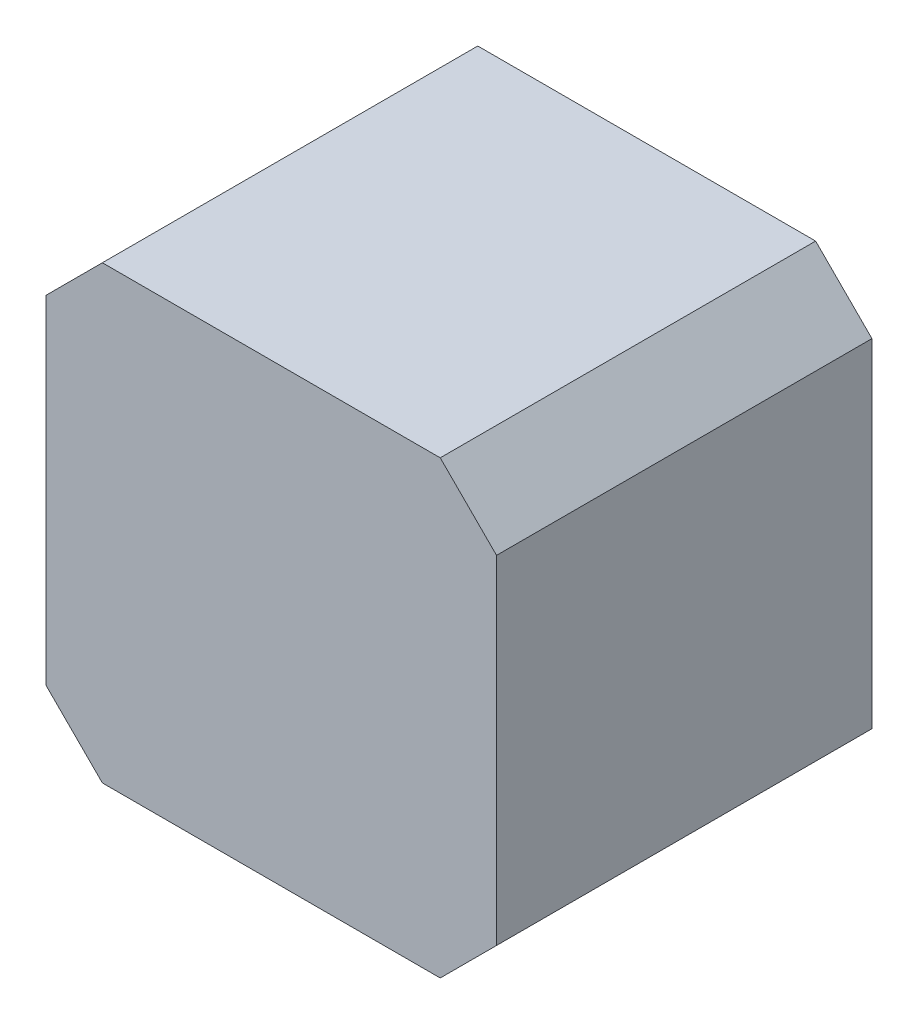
from build123d import *

# Parameters (mm, degrees)
SKETCH1_W      = 12
SKETCH1_H      = 12
EXTRUDE1_DEPTH = 5
CHAMFER1_SIZE  = 1.5


with BuildPart() as part:
    # Sketch1 → Extrude1 (new, symmetric)
    with BuildSketch(Plane.XY):
        with Locations((-6, 6)):
            Rectangle(SKETCH1_W, SKETCH1_H)
    extrude(amount=EXTRUDE1_DEPTH, both=True)

    # Chamfer1
    chamfer1_edges = [part.edges().sort_by_distance(p)[0] for p in [
        (0, 0, 0),
        (-12, 0, 0),
        (-12, 12, 0),
        (0, 12, 0),
    ]]
    chamfer(chamfer1_edges, length=CHAMFER1_SIZE)


solid = part.part
